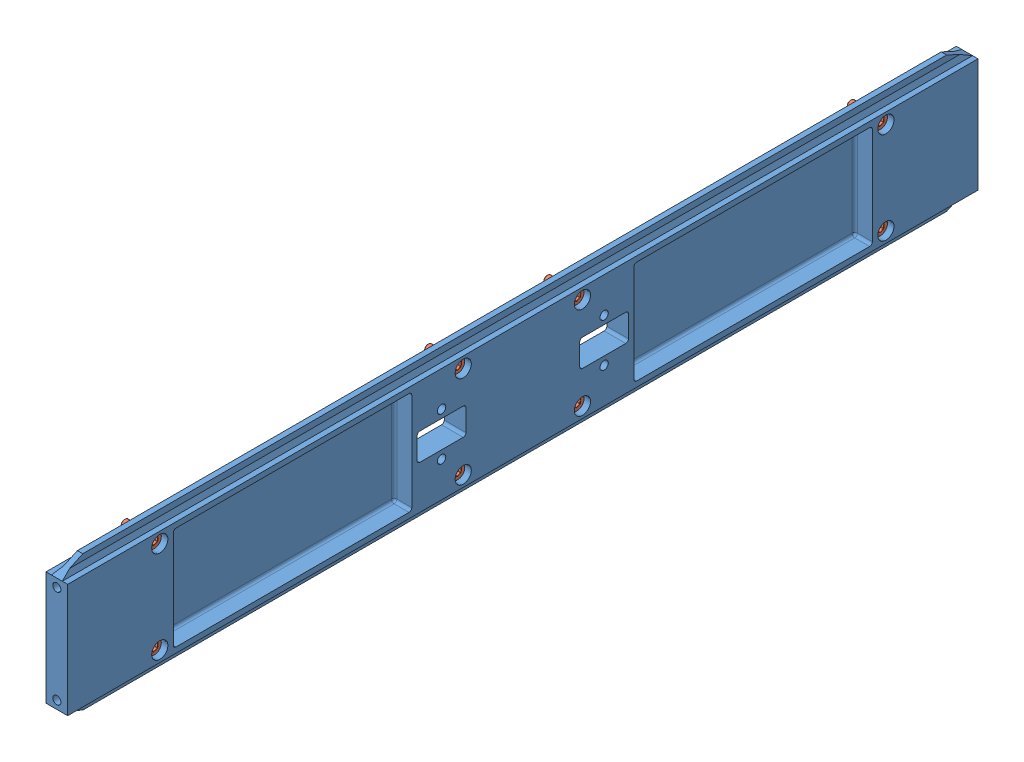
SolidWorks assembly body_structure_side.SLDASM, configuration Standard (file format 10000). Lengths in mm.
Overall size (13 50 336).
9 component instances, 2 part files, 16 mates.
Components (placement in the parent):
- body_structure_side-1: body_structure_side.SLDPRT [Standard] at origin size (8 50 336)
- fastener_shcs_m3_8-1: fastener_shcs_m3_8.SLDPRT [Standard] at (-1 17 -134) x (0 -0.924225 -0.381849) z (1 0 0) size (5.5 5.5 11)
- fastener_shcs_m3_8-2: fastener_shcs_m3_8.SLDPRT [Standard] at (-1 -17 -134) x (0 -0.924225 -0.381849) z (1 0 0) size (5.5 5.5 11)
- fastener_shcs_m3_8-3: fastener_shcs_m3_8.SLDPRT [Standard] at (-1 17 -22) x (0 -0.924225 -0.381849) z (1 0 0) size (5.5 5.5 11)
- fastener_shcs_m3_8-4: fastener_shcs_m3_8.SLDPRT [Standard] at (-1 -17 -22) x (0 -0.924225 -0.381849) z (1 0 0) size (5.5 5.5 11)
- fastener_shcs_m3_8-5: fastener_shcs_m3_8.SLDPRT [Standard] at (-1 -17 22) x (0 -0.924225 -0.381849) z (1 0 0) size (5.5 5.5 11)
- fastener_shcs_m3_8-6: fastener_shcs_m3_8.SLDPRT [Standard] at (-1 17 22) x (0 -0.924225 -0.381849) z (1 0 0) size (5.5 5.5 11)
- fastener_shcs_m3_8-7: fastener_shcs_m3_8.SLDPRT [Standard] at (-1 17 134) x (0 -0.924225 -0.381849) z (1 0 0) size (5.5 5.5 11)
- fastener_shcs_m3_8-8: fastener_shcs_m3_8.SLDPRT [Standard] at (-1 -17 134) x (0 -0.924225 -0.381849) z (1 0 0) size (5.5 5.5 11)
Mates (geometry in assembly coordinates):
- Konzentrisch1: concentric aligned: cylinder of body_structure_side-1 through (-4 -17 -134) axis (1 0 0) radius 1.5; cylinder of fastener_shcs_m3_8-2 through (20.9199 -17 -134) axis (1 0 0) radius 1.465
- Konzentrisch2: concentric aligned: cylinder of body_structure_side-1 through (-4 17 -134) axis (1 0 0) radius 1.5; cylinder of fastener_shcs_m3_8-1 through (20.9199 17 -134) axis (1 0 0) radius 1.465
- Konzentrisch3: concentric aligned: cylinder of body_structure_side-1 through (-4 -17 -22) axis (1 0 0) radius 1.5; cylinder of fastener_shcs_m3_8-4 through (20.9199 -17 -22) axis (1 0 0) radius 1.465
- Konzentrisch4: concentric aligned: cylinder of body_structure_side-1 through (-4 17 -22) axis (1 0 0) radius 1.5; cylinder of fastener_shcs_m3_8-3 through (20.9199 17 -22) axis (1 0 0) radius 1.465
- Konzentrisch5: concentric aligned: cylinder of body_structure_side-1 through (-4 17 22) axis (1 0 0) radius 1.5; cylinder of fastener_shcs_m3_8-6 through (20.9199 17 22) axis (1 0 0) radius 1.465
- Konzentrisch6: concentric aligned: cylinder of body_structure_side-1 through (-4 -17 22) axis (1 0 0) radius 1.5; cylinder of fastener_shcs_m3_8-5 through (20.9199 -17 22) axis (1 0 0) radius 1.465
- Konzentrisch7: concentric aligned: cylinder of body_structure_side-1 through (-4 -17 134) axis (1 0 0) radius 1.5; cylinder of fastener_shcs_m3_8-8 through (20.9199 -17 134) axis (1 0 0) radius 1.465
- Konzentrisch8: concentric aligned: cylinder of body_structure_side-1 through (-4 17 134) axis (1 0 0) radius 1.5; cylinder of fastener_shcs_m3_8-7 through (20.9199 17 134) axis (1 0 0) radius 1.465
- Deckungsgleich1: coincident anti-aligned: plane of body_structure_side-1 through (-1 17 134) normal (1 0 0); plane of fastener_shcs_m3_8-7 through (-1 18.0501 131.4584) normal (-1 0 0)
- Deckungsgleich2: coincident anti-aligned: plane of body_structure_side-1 through (-1 -17 134) normal (1 0 0); plane of fastener_shcs_m3_8-8 through (-1 -15.9499 131.4584) normal (-1 0 0)
- Deckungsgleich3: coincident anti-aligned: plane of body_structure_side-1 through (-1 17 22) normal (1 0 0); plane of fastener_shcs_m3_8-6 through (-1 18.0501 19.4584) normal (-1 0 0)
- Deckungsgleich4: coincident anti-aligned: plane of body_structure_side-1 through (-1 -17 22) normal (1 0 0); plane of fastener_shcs_m3_8-5 through (-1 -15.9499 19.4584) normal (-1 0 0)
- Deckungsgleich5: coincident anti-aligned: plane of body_structure_side-1 through (-1 -17 -22) normal (1 0 0); plane of fastener_shcs_m3_8-4 through (-1 -15.9499 -24.5416) normal (-1 0 0)
- Deckungsgleich6: coincident anti-aligned: plane of body_structure_side-1 through (-1 17 -22) normal (1 0 0); plane of fastener_shcs_m3_8-3 through (-1 18.0501 -24.5416) normal (-1 0 0)
- Deckungsgleich7: coincident anti-aligned: plane of body_structure_side-1 through (-1 17 -134) normal (1 0 0); plane of fastener_shcs_m3_8-1 through (-1 18.0501 -136.5416) normal (-1 0 0)
- Deckungsgleich8: coincident anti-aligned: plane of body_structure_side-1 through (-1 -17 -134) normal (1 0 0); plane of fastener_shcs_m3_8-2 through (-1 -15.9499 -136.5416) normal (-1 0 0)
